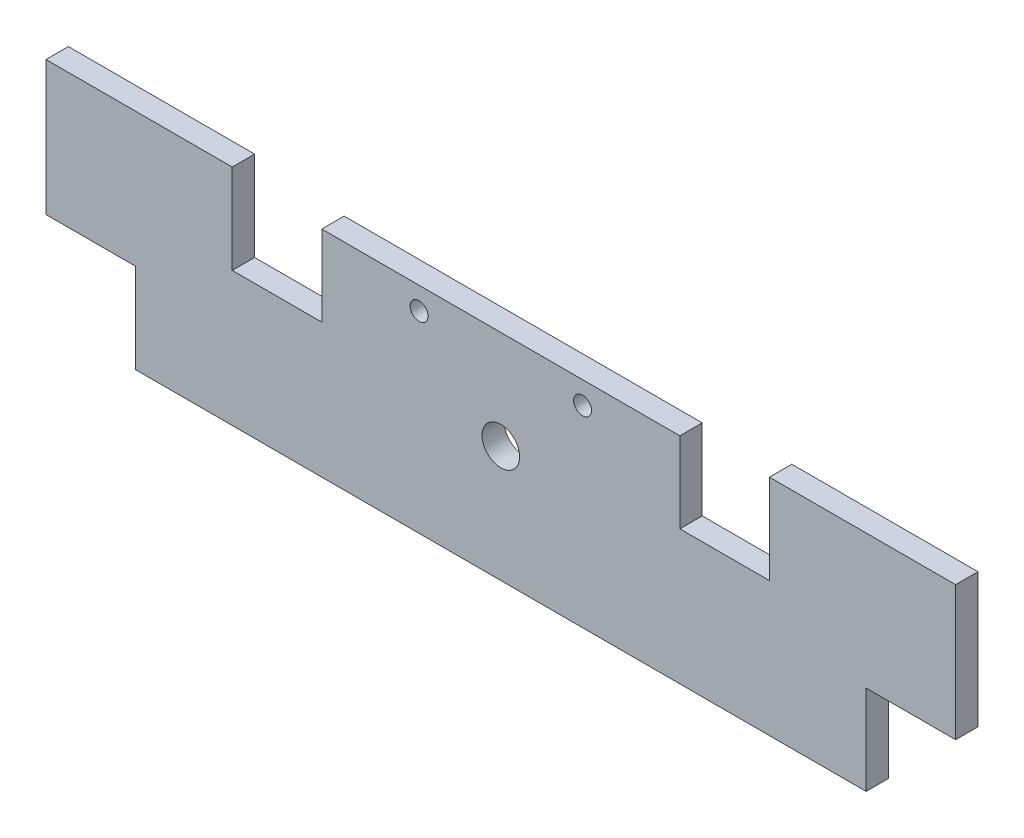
from build123d import *

# Parameters (mm, degrees)
SKETCH1_W                = 1016
SKETCH1_H                = 250
SKETCH1_R                = 21
BOSS_EXTRUDE1_DEPTH      = 12.5
SKETCH2_W                = 100
SKETCH2_H                = 100
CUT_EXTRUDE1_DEPTH       = 525.965713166
CUT_EXTRUDE11_DEPTH      = 525.51906543
CUT_EXTRUDE11_DEPTH_BACK = 525.51906543
SKETCH16_W               = 400
SKETCH16_H               = 10
CUT_EXTRUDE12_DEPTH      = 525.51906543
CUT_EXTRUDE12_DEPTH_BACK = 525.51906543
SKETCH17_R               = 10


with BuildPart() as part:
    # Sketch1 → Boss-Extrude1 (new, symmetric)
    with BuildSketch(Plane.XY):
        with Locations((0, -5)):
            Rectangle(SKETCH1_W, SKETCH1_H)
        Circle(SKETCH1_R, mode=Mode.SUBTRACT)
    extrude(amount=BOSS_EXTRUDE1_DEPTH, both=True)

    # Sketch2 → Cut-Extrude1 (cut, through all)
    with BuildSketch(Plane.XY.offset(12.5)):
        with Locations((-250, 70)):
            Rectangle(SKETCH2_W, SKETCH2_H)
        with Locations((250, 70)):
            Rectangle(SKETCH2_W, SKETCH2_H)
        with Locations((458, -80)):
            Rectangle(SKETCH2_W, SKETCH2_H)
        with Locations((-458, -80)):
            Rectangle(SKETCH2_W, SKETCH2_H)
    extrude(amount=-CUT_EXTRUDE1_DEPTH, mode=Mode.SUBTRACT)

    # Sketch16 → Cut-Extrude11 (cut, two sides: drawn at the far end of the back side and taken through both)
    with BuildSketch(Plane.XY.offset(-CUT_EXTRUDE11_DEPTH_BACK)):
        with Locations((0, 115)):
            Rectangle(SKETCH16_W, SKETCH16_H)
    extrude(amount=CUT_EXTRUDE11_DEPTH + CUT_EXTRUDE11_DEPTH_BACK, mode=Mode.SUBTRACT)

    # Sketch17 → Cut-Extrude12 (cut, two sides: drawn at the far end of the back side and taken through both)
    with BuildSketch(Plane.XY.offset(-CUT_EXTRUDE12_DEPTH_BACK)):
        with Locations((-91.297011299, 85)):
            Circle(SKETCH17_R)
        with Locations((91.297011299, 85)):
            Circle(SKETCH17_R)
    extrude(amount=CUT_EXTRUDE12_DEPTH + CUT_EXTRUDE12_DEPTH_BACK, mode=Mode.SUBTRACT)


solid = part.part
